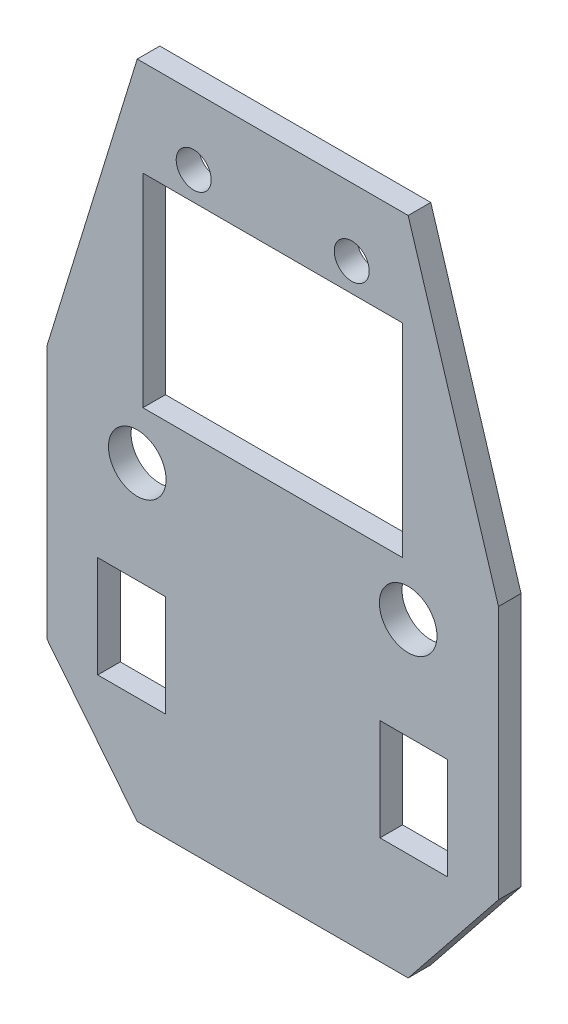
from build123d import *

# Parameters (mm, degrees)
PALM_FRAME_DEPTH                 = 2
SKETCH_2_R                       = 5.1
SKETCH_2_R_2                     = 3.1
GROUND_PIVOT_BORES_DEPTH         = 250
SKETCH_3_W                       = 46
SKETCH_3_H                       = 36
SKETCH_3_W_2                     = 12
SKETCH_3_H_2                     = 18
LINKAGE_INSPECTION_WINDOWS_DEPTH = 250


with BuildPart() as part:
    # Sketch 1 → Palm_Frame (new, symmetric)
    with BuildSketch(Plane.XY):
        Polygon((-40, -35), (-24, -55), (24, -55), (40, -35), (40, 10), (24, 62), (-24, 62), (-40, 10), align=None)
    extrude(amount=PALM_FRAME_DEPTH, both=True)

    # Sketch 2 → Ground_Pivot_Bores (cut, symmetric)
    with BuildSketch(Plane.XY):
        with Locations((-24, 0)):
            Circle(SKETCH_2_R)
        with Locations((24, 0)):
            Circle(SKETCH_2_R)
        with Locations((-14, 50)):
            Circle(SKETCH_2_R_2)
        with Locations((14, 50)):
            Circle(SKETCH_2_R_2)
    extrude(amount=GROUND_PIVOT_BORES_DEPTH, both=True, mode=Mode.SUBTRACT)

    # Sketch 3 → Linkage_Inspection_Windows (cut, symmetric)
    with BuildSketch(Plane.XY):
        with Locations((0, 27)):
            Rectangle(SKETCH_3_W, SKETCH_3_H)
        with Locations((-25, -27)):
            Rectangle(SKETCH_3_W_2, SKETCH_3_H_2)
        with Locations((25, -27)):
            Rectangle(SKETCH_3_W_2, SKETCH_3_H_2)
    extrude(amount=LINKAGE_INSPECTION_WINDOWS_DEPTH, both=True, mode=Mode.SUBTRACT)


solid = part.part
